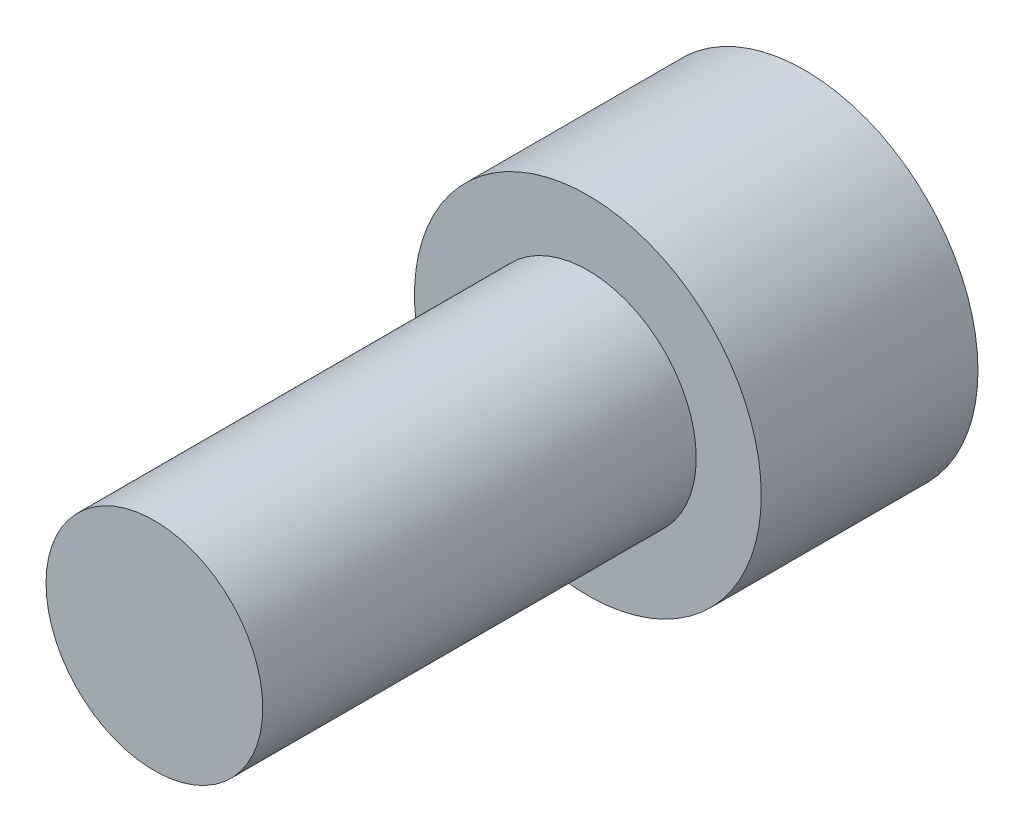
from build123d import *

# Parameters (mm, degrees)
HEX_2_DEPTH = 8


with BuildPart() as part:
    # Sketch6 → Revolve1 (revolve)
    with BuildSketch(Plane(origin=(0, 0, 0), x_dir=(0, 0, -1), z_dir=(1, 0, 0)), mode=Mode.PRIVATE) as revolve1_sk:
        Polygon((-20, 0), (-20, -5), (0, -5), (0, -8), (10, -8), (10, 0), align=None)
    revolve(revolve1_sk.sketch.rotate(Axis((0, 0, 20), (0, 0, -1)), 270), axis=Axis((0, 0, 20), (0, 0, -1)))

    # Sketch7 → HEX 2 (cut)
    with BuildSketch(Plane(origin=(0, 0, -10), x_dir=(-1, 0, 0), z_dir=(0, 0, -1))):
        Polygon((-4, 2.309401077), (-4, -2.309401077), (0, -4.618802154), (4, -2.309401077), (4, 2.309401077), (0, 4.618802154), align=None)
    extrude(amount=-HEX_2_DEPTH, mode=Mode.SUBTRACT)


solid = part.part
